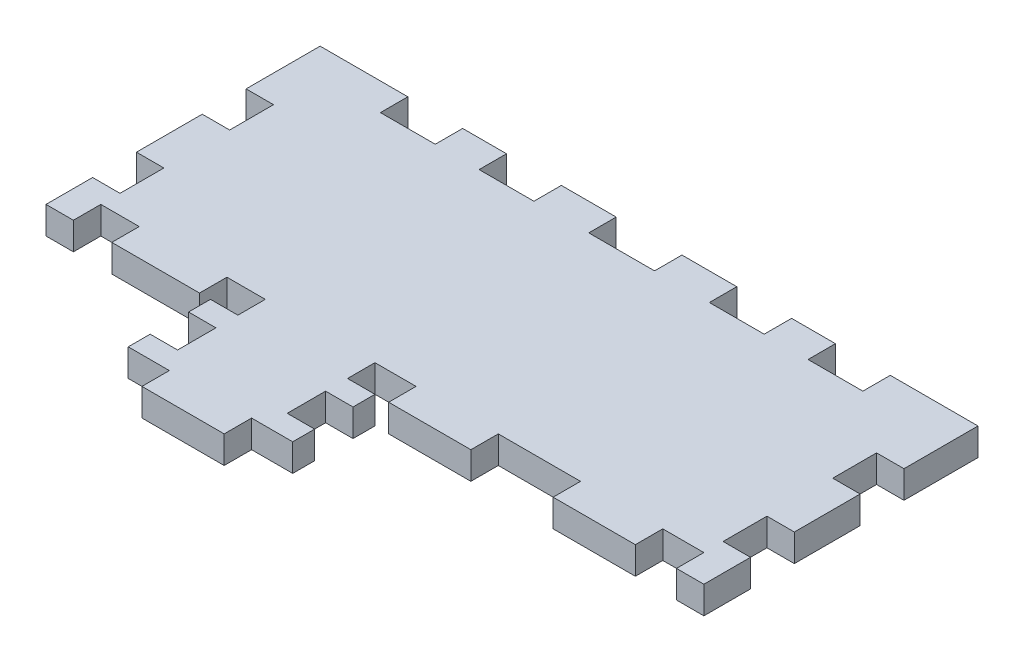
from build123d import *

# Parameters (mm, degrees)
BOSS_EXTRUDE1_DEPTH = 6.35
SKETCH3_R           = 1.905
CUT_EXTRUDE1_DEPTH  = 19.05
SKETCH5_R           = 1.905
CUT_EXTRUDE3_DEPTH  = 19.05


with BuildPart() as part:
    # Sketch1 → Boss-Extrude1 (new body)
    with BuildSketch(Plane(origin=(0, 0, 0), x_dir=(1, 0, 0), z_dir=(0, 1, 0))):
        Polygon((-152.4, 10.795), (-152.4, 0), (-146.05, 0), (-146.05, 6.35), (-137.16, 6.35), (-137.16, 0), (-116.84, 0), (-116.84, 6.35), (-107.95, 6.35), (-107.95, 0), (-114.3, 0), (-114.3, -5.08), (-107.95, -5.08), (-107.95, -13.97), (-114.3, -13.97), (-114.3, -19.05), (-104.775, -19.05), (-104.775, -25.4), (-85.725, -25.4), (-85.725, -19.05), (-76.2, -19.05), (-76.2, -13.97), (-82.55, -13.97), (-82.55, -5.08), (-76.2, -5.08), (-76.2, 0), (-82.55, 0), (-82.55, 6.35), (-73.025, 6.35), (-73.025, 0), (-53.975, 0), (-53.975, 6.35), (-34.925, 6.35), (-34.925, 0), (-15.875, 0), (-15.875, 6.35), (-6.35, 6.35), (-6.35, 0), (0, 0), (0, 10.795), (-6.35, 10.795), (-6.35, 20.955), (0, 20.955), (0, 36.195), (-6.35, 36.195), (-6.35, 46.355), (0, 46.355), (0, 63.5), (-20.32, 63.5), (-20.32, 57.15), (-33.02, 57.15), (-33.02, 63.5), (-43.18, 63.5), (-43.18, 57.15), (-55.88, 57.15), (-55.88, 63.5), (-68.58, 63.5), (-68.58, 57.15), (-83.82, 57.15), (-83.82, 63.5), (-96.52, 63.5), (-96.52, 57.15), (-109.22, 57.15), (-109.22, 63.5), (-119.38, 63.5), (-119.38, 57.15), (-132.08, 57.15), (-132.08, 63.5), (-152.4, 63.5), (-152.4, 46.355), (-146.05, 46.355), (-146.05, 36.195), (-152.4, 36.195), (-152.4, 20.955), (-146.05, 20.955), (-146.05, 10.795), align=None)
    extrude(amount=BOSS_EXTRUDE1_DEPTH)

    # Sketch3 → Cut-Extrude1 (cut)
    with BuildSketch(Plane(origin=(0, 0, -57.15), x_dir=(-1, 0, 0), z_dir=(0, 0, -1))):
        with Locations((26.67, 3.175)):
            Circle(SKETCH3_R)
    extrude(amount=-CUT_EXTRUDE1_DEPTH, mode=Mode.SUBTRACT)

    # Sketch5 → Cut-Extrude3 (cut)
    with BuildSketch(Plane(origin=(0, 0, -57.15), x_dir=(-1, 0, 0), z_dir=(0, 0, -1))):
        with Locations((125.73, 3.175)):
            Circle(SKETCH5_R)
    extrude(amount=-CUT_EXTRUDE3_DEPTH, mode=Mode.SUBTRACT)


solid = part.part
